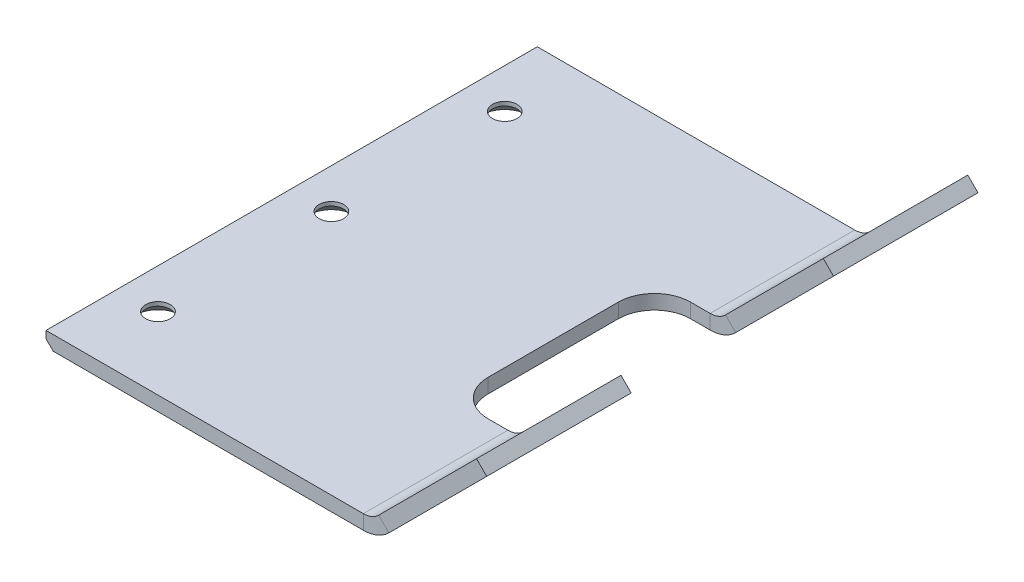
ISO-10303-21;
HEADER;
FILE_DESCRIPTION(('STEP AP214'),'2;1');
FILE_NAME('part.step','',(''),(''),'','','');
FILE_SCHEMA(('AUTOMOTIVE_DESIGN { 1 0 10303 214 1 1 1 1 }'));
ENDSEC;
DATA;
#1=APPLICATION_CONTEXT('core data for automotive mechanical design processes');
#2=APPLICATION_PROTOCOL_DEFINITION('international standard','automotive_design',2000,#1);
#3=PRODUCT_CONTEXT('',#1,'mechanical');
#4=PRODUCT('Part','Part','',(#3));
#5=PRODUCT_RELATED_PRODUCT_CATEGORY('part','',(#4));
#6=PRODUCT_DEFINITION_FORMATION('','',#4);
#7=PRODUCT_DEFINITION_CONTEXT('part definition',#1,'design');
#8=PRODUCT_DEFINITION('design','',#6,#7);
#9=PRODUCT_DEFINITION_SHAPE('','',#8);
#10=(LENGTH_UNIT() NAMED_UNIT(*) SI_UNIT(.MILLI.,.METRE.));
#11=(NAMED_UNIT(*) PLANE_ANGLE_UNIT() SI_UNIT($,.RADIAN.));
#12=(NAMED_UNIT(*) SI_UNIT($,.STERADIAN.) SOLID_ANGLE_UNIT());
#13=UNCERTAINTY_MEASURE_WITH_UNIT(LENGTH_MEASURE(1.E-05),#10,'distance_accuracy_value','');
#14=(GEOMETRIC_REPRESENTATION_CONTEXT(3) GLOBAL_UNCERTAINTY_ASSIGNED_CONTEXT((#13)) GLOBAL_UNIT_ASSIGNED_CONTEXT((#10,
#11,#12)) REPRESENTATION_CONTEXT('',''));
#15=CARTESIAN_POINT('',(0.,0.,0.));
#16=DIRECTION('',(0.,0.,1.));
#17=DIRECTION('',(1.,0.,0.));
#18=AXIS2_PLACEMENT_3D('',#15,#16,#17);
#19=CARTESIAN_POINT('',(-40.3183812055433,116.318381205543,34.));
#20=DIRECTION('',(-0.707106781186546,-0.707106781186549,0.));
#21=DIRECTION('',(0.707106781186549,-0.707106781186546,0.));
#22=AXIS2_PLACEMENT_3D('',#19,#20,#21);
#23=PLANE('',#22);
#24=DIRECTION('',(0.,0.,-1.));
#25=VECTOR('',#24,1.);
#26=CARTESIAN_POINT('',(61.,15.,34.));
#27=LINE('',#26,#25);
#28=CARTESIAN_POINT('',(61.,15.,34.));
#29=VERTEX_POINT('',#28);
#30=CARTESIAN_POINT('',(61.,15.,14.));
#31=VERTEX_POINT('',#30);
#32=EDGE_CURVE('E194',#29,#31,#27,.T.);
#33=ORIENTED_EDGE('',*,*,#32,.T.);
#34=DIRECTION('',(-0.707106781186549,0.707106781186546,0.));
#35=VECTOR('',#34,1.);
#36=CARTESIAN_POINT('',(144.908974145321,-68.9089741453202,14.));
#37=LINE('',#36,#35);
#38=CARTESIAN_POINT('',(59.5857864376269,16.4142135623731,14.));
#39=VERTEX_POINT('',#38);
#40=EDGE_CURVE('E215',#31,#39,#37,.T.);
#41=ORIENTED_EDGE('',*,*,#40,.T.);
#42=DIRECTION('',(0.,0.,-1.));
#43=VECTOR('',#42,1.);
#44=CARTESIAN_POINT('',(59.5857864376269,16.4142135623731,34.));
#45=LINE('',#44,#43);
#46=CARTESIAN_POINT('',(59.5857864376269,16.4142135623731,34.));
#47=VERTEX_POINT('',#46);
#48=EDGE_CURVE('E197',#47,#39,#45,.T.);
#49=ORIENTED_EDGE('',*,*,#48,.F.);
#50=DIRECTION('',(0.707106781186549,-0.707106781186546,0.));
#51=VECTOR('',#50,1.);
#52=CARTESIAN_POINT('',(-40.3183812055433,116.318381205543,34.));
#53=LINE('',#52,#51);
#54=EDGE_CURVE('E212',#47,#29,#53,.T.);
#55=ORIENTED_EDGE('',*,*,#54,.T.);
#56=EDGE_LOOP('',(#33,#41,#49,#55));
#57=FACE_BOUND('',#56,.T.);
#58=ADVANCED_FACE('F33',(#57),#23,.F.);
#59=CARTESIAN_POINT('',(-53.853915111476,102.78284729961,34.));
#60=DIRECTION('',(0.,0.,-1.));
#61=DIRECTION('',(-0.707106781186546,-0.707106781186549,0.));
#62=AXIS2_PLACEMENT_3D('',#59,#60,#61);
#63=PLANE('',#62);
#64=DIRECTION('',(0.707106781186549,-0.707106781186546,0.));
#65=VECTOR('',#64,1.);
#66=CARTESIAN_POINT('',(-53.853915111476,102.78284729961,34.));
#67=LINE('',#66,#65);
#68=CARTESIAN_POINT('',(46.0502525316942,2.87867965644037,34.));
#69=VERTEX_POINT('',#68);
#70=CARTESIAN_POINT('',(47.4644660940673,1.46446609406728,34.));
#71=VERTEX_POINT('',#70);
#72=EDGE_CURVE('E209',#69,#71,#67,.T.);
#73=ORIENTED_EDGE('',*,*,#72,.T.);
#74=DIRECTION('',(0.707106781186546,0.707106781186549,0.));
#75=VECTOR('',#74,1.);
#76=CARTESIAN_POINT('',(47.4644660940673,1.46446609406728,34.));
#77=LINE('',#76,#75);
#78=EDGE_CURVE('E206',#71,#29,#77,.T.);
#79=ORIENTED_EDGE('',*,*,#78,.T.);
#80=ORIENTED_EDGE('',*,*,#54,.F.);
#81=DIRECTION('',(0.707106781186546,0.707106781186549,0.));
#82=VECTOR('',#81,1.);
#83=CARTESIAN_POINT('',(46.0502525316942,2.87867965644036,34.));
#84=LINE('',#83,#82);
#85=EDGE_CURVE('E198',#69,#47,#84,.T.);
#86=ORIENTED_EDGE('',*,*,#85,.F.);
#87=EDGE_LOOP('',(#73,#79,#80,#86));
#88=FACE_BOUND('',#87,.T.);
#89=ADVANCED_FACE('F440',(#88),#63,.F.);
#90=CARTESIAN_POINT('',(47.4644660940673,1.46446609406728,34.));
#91=DIRECTION('',(-0.707106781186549,0.707106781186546,0.));
#92=DIRECTION('',(-0.707106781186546,-0.707106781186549,0.));
#93=AXIS2_PLACEMENT_3D('',#90,#91,#92);
#94=PLANE('',#93);
#95=DIRECTION('',(0.,0.,-1.));
#96=VECTOR('',#95,1.);
#97=CARTESIAN_POINT('',(47.4644660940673,1.46446609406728,34.));
#98=LINE('',#97,#96);
#99=CARTESIAN_POINT('',(47.4644660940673,1.46446609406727,14.));
#100=VERTEX_POINT('',#99);
#101=EDGE_CURVE('E201',#71,#100,#98,.T.);
#102=ORIENTED_EDGE('',*,*,#101,.T.);
#103=DIRECTION('',(0.707106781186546,0.707106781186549,0.));
#104=VECTOR('',#103,1.);
#105=CARTESIAN_POINT('',(47.4644660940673,1.46446609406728,14.));
#106=LINE('',#105,#104);
#107=EDGE_CURVE('E192',#100,#31,#106,.T.);
#108=ORIENTED_EDGE('',*,*,#107,.T.);
#109=ORIENTED_EDGE('',*,*,#32,.F.);
#110=ORIENTED_EDGE('',*,*,#78,.F.);
#111=EDGE_LOOP('',(#102,#108,#109,#110));
#112=FACE_BOUND('',#111,.T.);
#113=ADVANCED_FACE('F446',(#112),#94,.F.);
#114=CARTESIAN_POINT('',(127.231304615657,-86.586643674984,14.));
#115=DIRECTION('',(0.,0.,1.));
#116=DIRECTION('',(0.707106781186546,0.707106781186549,0.));
#117=AXIS2_PLACEMENT_3D('',#114,#115,#116);
#118=PLANE('',#117);
#119=DIRECTION('',(0.707106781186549,-0.707106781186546,0.));
#120=VECTOR('',#119,1.);
#121=CARTESIAN_POINT('',(131.373440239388,-82.444508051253,14.));
#122=LINE('',#121,#120);
#123=CARTESIAN_POINT('',(46.0502525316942,2.87867965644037,14.));
#124=VERTEX_POINT('',#123);
#125=EDGE_CURVE('E176',#124,#100,#122,.T.);
#126=ORIENTED_EDGE('',*,*,#125,.F.);
#127=DIRECTION('',(0.707106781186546,0.707106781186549,0.));
#128=VECTOR('',#127,1.);
#129=CARTESIAN_POINT('',(46.0502525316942,2.87867965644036,14.));
#130=LINE('',#129,#128);
#131=EDGE_CURVE('E189',#124,#39,#130,.T.);
#132=ORIENTED_EDGE('',*,*,#131,.T.);
#133=ORIENTED_EDGE('',*,*,#40,.F.);
#134=ORIENTED_EDGE('',*,*,#107,.F.);
#135=EDGE_LOOP('',(#126,#132,#133,#134));
#136=FACE_BOUND('',#135,.T.);
#137=ADVANCED_FACE('F188',(#136),#118,.F.);
#138=CARTESIAN_POINT('',(46.0502525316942,2.87867965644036,34.));
#139=DIRECTION('',(-0.707106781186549,0.707106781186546,0.));
#140=DIRECTION('',(-0.707106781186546,-0.707106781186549,0.));
#141=AXIS2_PLACEMENT_3D('',#138,#139,#140);
#142=PLANE('',#141);
#143=ORIENTED_EDGE('',*,*,#131,.F.);
#144=DIRECTION('',(0.,0.,-1.));
#145=VECTOR('',#144,1.);
#146=CARTESIAN_POINT('',(46.0502525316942,2.87867965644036,34.));
#147=LINE('',#146,#145);
#148=EDGE_CURVE('E165',#69,#124,#147,.T.);
#149=ORIENTED_EDGE('',*,*,#148,.F.);
#150=ORIENTED_EDGE('',*,*,#85,.T.);
#151=ORIENTED_EDGE('',*,*,#48,.T.);
#152=EDGE_LOOP('',(#143,#149,#150,#151));
#153=FACE_BOUND('',#152,.T.);
#154=ADVANCED_FACE('F35',(#153),#142,.T.);
#155=CARTESIAN_POINT('',(-40.3183812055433,116.318381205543,34.));
#156=DIRECTION('',(-0.707106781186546,-0.707106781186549,0.));
#157=DIRECTION('',(0.707106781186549,-0.707106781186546,0.));
#158=AXIS2_PLACEMENT_3D('',#155,#156,#157);
#159=PLANE('',#158);
#160=DIRECTION('',(0.,0.,-1.));
#161=VECTOR('',#160,1.);
#162=CARTESIAN_POINT('',(59.5857864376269,16.4142135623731,34.));
#163=LINE('',#162,#161);
#164=CARTESIAN_POINT('',(59.5857864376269,16.4142135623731,-14.));
#165=VERTEX_POINT('',#164);
#166=CARTESIAN_POINT('',(59.5857864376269,16.4142135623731,-34.));
#167=VERTEX_POINT('',#166);
#168=EDGE_CURVE('E177',#165,#167,#163,.T.);
#169=ORIENTED_EDGE('',*,*,#168,.F.);
#170=DIRECTION('',(-0.707106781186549,0.707106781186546,0.));
#171=VECTOR('',#170,1.);
#172=CARTESIAN_POINT('',(144.908974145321,-68.9089741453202,-14.));
#173=LINE('',#172,#171);
#174=CARTESIAN_POINT('',(61.,15.,-14.));
#175=VERTEX_POINT('',#174);
#176=EDGE_CURVE('E236',#175,#165,#173,.T.);
#177=ORIENTED_EDGE('',*,*,#176,.F.);
#178=DIRECTION('',(0.,0.,-1.));
#179=VECTOR('',#178,1.);
#180=CARTESIAN_POINT('',(61.,15.,34.));
#181=LINE('',#180,#179);
#182=CARTESIAN_POINT('',(61.,15.,-34.));
#183=VERTEX_POINT('',#182);
#184=EDGE_CURVE('E234',#175,#183,#181,.T.);
#185=ORIENTED_EDGE('',*,*,#184,.T.);
#186=DIRECTION('',(0.707106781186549,-0.707106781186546,0.));
#187=VECTOR('',#186,1.);
#188=CARTESIAN_POINT('',(-40.3183812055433,116.318381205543,-34.));
#189=LINE('',#188,#187);
#190=EDGE_CURVE('E253',#167,#183,#189,.T.);
#191=ORIENTED_EDGE('',*,*,#190,.F.);
#192=EDGE_LOOP('',(#169,#177,#185,#191));
#193=FACE_BOUND('',#192,.T.);
#194=ADVANCED_FACE('F425',(#193),#159,.F.);
#195=CARTESIAN_POINT('',(127.231304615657,-86.586643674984,-14.));
#196=DIRECTION('',(0.,0.,-1.));
#197=DIRECTION('',(-0.707106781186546,-0.707106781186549,0.));
#198=AXIS2_PLACEMENT_3D('',#195,#196,#197);
#199=PLANE('',#198);
#200=DIRECTION('',(-0.707106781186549,0.707106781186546,0.));
#201=VECTOR('',#200,1.);
#202=CARTESIAN_POINT('',(131.373440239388,-82.444508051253,-14.));
#203=LINE('',#202,#201);
#204=CARTESIAN_POINT('',(47.4644660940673,1.46446609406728,-14.));
#205=VERTEX_POINT('',#204);
#206=CARTESIAN_POINT('',(46.0502525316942,2.87867965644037,-14.));
#207=VERTEX_POINT('',#206);
#208=EDGE_CURVE('E226',#205,#207,#203,.T.);
#209=ORIENTED_EDGE('',*,*,#208,.F.);
#210=DIRECTION('',(-0.707106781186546,-0.707106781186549,0.));
#211=VECTOR('',#210,1.);
#212=CARTESIAN_POINT('',(47.4644660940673,1.46446609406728,-14.));
#213=LINE('',#212,#211);
#214=EDGE_CURVE('E241',#175,#205,#213,.T.);
#215=ORIENTED_EDGE('',*,*,#214,.F.);
#216=ORIENTED_EDGE('',*,*,#176,.T.);
#217=DIRECTION('',(-0.707106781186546,-0.707106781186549,0.));
#218=VECTOR('',#217,1.);
#219=CARTESIAN_POINT('',(46.0502525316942,2.87867965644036,-14.));
#220=LINE('',#219,#218);
#221=EDGE_CURVE('E238',#165,#207,#220,.T.);
#222=ORIENTED_EDGE('',*,*,#221,.T.);
#223=EDGE_LOOP('',(#209,#215,#216,#222));
#224=FACE_BOUND('',#223,.T.);
#225=ADVANCED_FACE('F415',(#224),#199,.F.);
#226=CARTESIAN_POINT('',(47.4644660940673,1.46446609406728,34.));
#227=DIRECTION('',(-0.707106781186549,0.707106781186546,0.));
#228=DIRECTION('',(-0.707106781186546,-0.707106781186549,0.));
#229=AXIS2_PLACEMENT_3D('',#226,#227,#228);
#230=PLANE('',#229);
#231=ORIENTED_EDGE('',*,*,#184,.F.);
#232=ORIENTED_EDGE('',*,*,#214,.T.);
#233=DIRECTION('',(0.,0.,-1.));
#234=VECTOR('',#233,1.);
#235=CARTESIAN_POINT('',(47.4644660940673,1.46446609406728,34.));
#236=LINE('',#235,#234);
#237=CARTESIAN_POINT('',(47.4644660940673,1.46446609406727,-34.));
#238=VERTEX_POINT('',#237);
#239=EDGE_CURVE('E244',#205,#238,#236,.T.);
#240=ORIENTED_EDGE('',*,*,#239,.T.);
#241=DIRECTION('',(0.707106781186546,0.707106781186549,0.));
#242=VECTOR('',#241,1.);
#243=CARTESIAN_POINT('',(47.4644660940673,1.46446609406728,-34.));
#244=LINE('',#243,#242);
#245=EDGE_CURVE('E247',#238,#183,#244,.T.);
#246=ORIENTED_EDGE('',*,*,#245,.T.);
#247=EDGE_LOOP('',(#231,#232,#240,#246));
#248=FACE_BOUND('',#247,.T.);
#249=ADVANCED_FACE('F420',(#248),#230,.F.);
#250=CARTESIAN_POINT('',(-53.853915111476,102.78284729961,-34.));
#251=DIRECTION('',(0.,0.,-1.));
#252=DIRECTION('',(-0.707106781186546,-0.707106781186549,0.));
#253=AXIS2_PLACEMENT_3D('',#250,#251,#252);
#254=PLANE('',#253);
#255=ORIENTED_EDGE('',*,*,#245,.F.);
#256=DIRECTION('',(0.707106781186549,-0.707106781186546,0.));
#257=VECTOR('',#256,1.);
#258=CARTESIAN_POINT('',(-53.853915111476,102.78284729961,-34.));
#259=LINE('',#258,#257);
#260=CARTESIAN_POINT('',(46.0502525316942,2.87867965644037,-34.));
#261=VERTEX_POINT('',#260);
#262=EDGE_CURVE('E231',#261,#238,#259,.T.);
#263=ORIENTED_EDGE('',*,*,#262,.F.);
#264=DIRECTION('',(0.707106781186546,0.707106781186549,0.));
#265=VECTOR('',#264,1.);
#266=CARTESIAN_POINT('',(46.0502525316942,2.87867965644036,-34.));
#267=LINE('',#266,#265);
#268=EDGE_CURVE('E250',#261,#167,#267,.T.);
#269=ORIENTED_EDGE('',*,*,#268,.T.);
#270=ORIENTED_EDGE('',*,*,#190,.T.);
#271=EDGE_LOOP('',(#255,#263,#269,#270));
#272=FACE_BOUND('',#271,.T.);
#273=ADVANCED_FACE('F430',(#272),#254,.T.);
#274=CARTESIAN_POINT('',(46.0502525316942,2.87867965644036,34.));
#275=DIRECTION('',(-0.707106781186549,0.707106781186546,0.));
#276=DIRECTION('',(-0.707106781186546,-0.707106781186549,0.));
#277=AXIS2_PLACEMENT_3D('',#274,#275,#276);
#278=PLANE('',#277);
#279=ORIENTED_EDGE('',*,*,#221,.F.);
#280=ORIENTED_EDGE('',*,*,#168,.T.);
#281=ORIENTED_EDGE('',*,*,#268,.F.);
#282=DIRECTION('',(0.,0.,-1.));
#283=VECTOR('',#282,1.);
#284=CARTESIAN_POINT('',(46.0502525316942,2.87867965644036,34.));
#285=LINE('',#284,#283);
#286=EDGE_CURVE('E228',#207,#261,#285,.T.);
#287=ORIENTED_EDGE('',*,*,#286,.F.);
#288=EDGE_LOOP('',(#279,#280,#281,#287));
#289=FACE_BOUND('',#288,.T.);
#290=ADVANCED_FACE('F427',(#289),#278,.T.);
#291=CARTESIAN_POINT('',(41.2126604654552,-118.665209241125,-14.));
#292=DIRECTION('',(0.,0.,-1.));
#293=DIRECTION('',(-1.,0.,0.));
#294=AXIS2_PLACEMENT_3D('',#291,#292,#293);
#295=PLANE('',#294);
#296=DIRECTION('',(-1.,0.,0.));
#297=VECTOR('',#296,1.);
#298=CARTESIAN_POINT('',(0.,0.,-14.));
#299=LINE('',#298,#297);
#300=CARTESIAN_POINT('',(43.9289321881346,0.,-14.));
#301=VERTEX_POINT('',#300);
#302=CARTESIAN_POINT('',(41.2126604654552,0.,-14.));
#303=VERTEX_POINT('',#302);
#304=EDGE_CURVE('E332',#301,#303,#299,.T.);
#305=ORIENTED_EDGE('',*,*,#304,.F.);
#306=DIRECTION('',(0.,1.,0.));
#307=VECTOR('',#306,1.);
#308=CARTESIAN_POINT('',(43.9289321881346,-118.665209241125,-14.));
#309=LINE('',#308,#307);
#310=CARTESIAN_POINT('',(43.9289321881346,2.,-14.));
#311=VERTEX_POINT('',#310);
#312=EDGE_CURVE('E229',#301,#311,#309,.T.);
#313=ORIENTED_EDGE('',*,*,#312,.T.);
#314=DIRECTION('',(-1.,0.,0.));
#315=VECTOR('',#314,1.);
#316=CARTESIAN_POINT('',(0.,2.,-14.));
#317=LINE('',#316,#315);
#318=CARTESIAN_POINT('',(41.2126604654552,2.,-14.));
#319=VERTEX_POINT('',#318);
#320=EDGE_CURVE('E335',#311,#319,#317,.T.);
#321=ORIENTED_EDGE('',*,*,#320,.T.);
#322=DIRECTION('',(0.,1.,0.));
#323=VECTOR('',#322,1.);
#324=CARTESIAN_POINT('',(41.2126604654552,-118.665209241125,-14.));
#325=LINE('',#324,#323);
#326=EDGE_CURVE('E342',#303,#319,#325,.T.);
#327=ORIENTED_EDGE('',*,*,#326,.F.);
#328=EDGE_LOOP('',(#305,#313,#321,#327));
#329=FACE_BOUND('',#328,.T.);
#330=ADVANCED_FACE('F401',(#329),#295,.F.);
#331=CARTESIAN_POINT('',(41.2126604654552,-118.665209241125,14.));
#332=DIRECTION('',(0.,0.,1.));
#333=DIRECTION('',(1.,0.,0.));
#334=AXIS2_PLACEMENT_3D('',#331,#332,#333);
#335=PLANE('',#334);
#336=DIRECTION('',(1.,0.,0.));
#337=VECTOR('',#336,1.);
#338=CARTESIAN_POINT('',(0.,2.,14.));
#339=LINE('',#338,#337);
#340=CARTESIAN_POINT('',(41.2126604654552,2.,14.));
#341=VERTEX_POINT('',#340);
#342=CARTESIAN_POINT('',(43.9289321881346,2.,14.));
#343=VERTEX_POINT('',#342);
#344=EDGE_CURVE('E340',#341,#343,#339,.T.);
#345=ORIENTED_EDGE('',*,*,#344,.T.);
#346=DIRECTION('',(0.,-1.,0.));
#347=VECTOR('',#346,1.);
#348=CARTESIAN_POINT('',(43.9289321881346,-118.665209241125,14.));
#349=LINE('',#348,#347);
#350=CARTESIAN_POINT('',(43.9289321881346,0.,14.));
#351=VERTEX_POINT('',#350);
#352=EDGE_CURVE('E185',#343,#351,#349,.T.);
#353=ORIENTED_EDGE('',*,*,#352,.T.);
#354=DIRECTION('',(1.,0.,0.));
#355=VECTOR('',#354,1.);
#356=CARTESIAN_POINT('',(0.,0.,14.));
#357=LINE('',#356,#355);
#358=CARTESIAN_POINT('',(41.2126604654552,0.,14.));
#359=VERTEX_POINT('',#358);
#360=EDGE_CURVE('E337',#359,#351,#357,.T.);
#361=ORIENTED_EDGE('',*,*,#360,.F.);
#362=DIRECTION('',(0.,1.,0.));
#363=VECTOR('',#362,1.);
#364=CARTESIAN_POINT('',(41.2126604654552,-118.665209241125,14.));
#365=LINE('',#364,#363);
#366=EDGE_CURVE('E351',#359,#341,#365,.T.);
#367=ORIENTED_EDGE('',*,*,#366,.T.);
#368=EDGE_LOOP('',(#345,#353,#361,#367));
#369=FACE_BOUND('',#368,.T.);
#370=ADVANCED_FACE('F465',(#369),#335,.F.);
#371=CARTESIAN_POINT('',(0.,0.,34.));
#372=DIRECTION('',(0.,1.,0.));
#373=DIRECTION('',(0.,0.,1.));
#374=AXIS2_PLACEMENT_3D('',#371,#372,#373);
#375=PLANE('',#374);
#376=CARTESIAN_POINT('',(5.5,0.,0.));
#377=DIRECTION('',(0.,-1.,0.));
#378=DIRECTION('',(0.,0.,-1.));
#379=AXIS2_PLACEMENT_3D('',#376,#377,#378);
#380=CIRCLE('',#379,3.15);
#381=CARTESIAN_POINT('',(5.5,0.,-3.15));
#382=VERTEX_POINT('',#381);
#383=EDGE_CURVE('E320',#382,#382,#380,.T.);
#384=ORIENTED_EDGE('',*,*,#383,.F.);
#385=EDGE_LOOP('',(#384));
#386=FACE_BOUND('',#385,.T.);
#387=CARTESIAN_POINT('',(5.5,0.,24.));
#388=DIRECTION('',(0.,-1.,0.));
#389=DIRECTION('',(0.,0.,-1.));
#390=AXIS2_PLACEMENT_3D('',#387,#388,#389);
#391=CIRCLE('',#390,3.15);
#392=CARTESIAN_POINT('',(5.5,0.,20.85));
#393=VERTEX_POINT('',#392);
#394=EDGE_CURVE('E311',#393,#393,#391,.T.);
#395=ORIENTED_EDGE('',*,*,#394,.F.);
#396=EDGE_LOOP('',(#395));
#397=FACE_BOUND('',#396,.T.);
#398=DIRECTION('',(1.,0.,0.));
#399=VECTOR('',#398,1.);
#400=CARTESIAN_POINT('',(0.,0.,34.));
#401=LINE('',#400,#399);
#402=CARTESIAN_POINT('',(0.999999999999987,0.,34.));
#403=VERTEX_POINT('',#402);
#404=CARTESIAN_POINT('',(43.9289321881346,0.,34.));
#405=VERTEX_POINT('',#404);
#406=EDGE_CURVE('E297',#403,#405,#401,.T.);
#407=ORIENTED_EDGE('',*,*,#406,.F.);
#408=DIRECTION('',(0.,0.,-1.));
#409=VECTOR('',#408,1.);
#410=CARTESIAN_POINT('',(0.999999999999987,0.,-34.));
#411=LINE('',#410,#409);
#412=CARTESIAN_POINT('',(1.00000000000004,0.,-34.));
#413=VERTEX_POINT('',#412);
#414=EDGE_CURVE('E219',#403,#413,#411,.T.);
#415=ORIENTED_EDGE('',*,*,#414,.T.);
#416=DIRECTION('',(1.,0.,0.));
#417=VECTOR('',#416,1.);
#418=CARTESIAN_POINT('',(0.,0.,-34.));
#419=LINE('',#418,#417);
#420=CARTESIAN_POINT('',(43.9289321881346,0.,-34.));
#421=VERTEX_POINT('',#420);
#422=EDGE_CURVE('E303',#413,#421,#419,.T.);
#423=ORIENTED_EDGE('',*,*,#422,.T.);
#424=DIRECTION('',(0.,0.,-1.));
#425=VECTOR('',#424,1.);
#426=CARTESIAN_POINT('',(43.9289321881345,0.,34.));
#427=LINE('',#426,#425);
#428=EDGE_CURVE('E302',#301,#421,#427,.T.);
#429=ORIENTED_EDGE('',*,*,#428,.F.);
#430=ORIENTED_EDGE('',*,*,#304,.T.);
#431=CARTESIAN_POINT('',(41.2126604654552,0.,-9.));
#432=DIRECTION('',(0.,1.,0.));
#433=DIRECTION('',(0.,0.,1.));
#434=AXIS2_PLACEMENT_3D('',#431,#432,#433);
#435=CIRCLE('',#434,5.);
#436=CARTESIAN_POINT('',(36.2126604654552,0.,-9.));
#437=VERTEX_POINT('',#436);
#438=EDGE_CURVE('E323',#303,#437,#435,.T.);
#439=ORIENTED_EDGE('',*,*,#438,.T.);
#440=DIRECTION('',(0.,0.,1.));
#441=VECTOR('',#440,1.);
#442=CARTESIAN_POINT('',(36.2126604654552,0.,34.));
#443=LINE('',#442,#441);
#444=CARTESIAN_POINT('',(36.2126604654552,0.,9.));
#445=VERTEX_POINT('',#444);
#446=EDGE_CURVE('E326',#437,#445,#443,.T.);
#447=ORIENTED_EDGE('',*,*,#446,.T.);
#448=CARTESIAN_POINT('',(41.2126604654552,0.,9.));
#449=DIRECTION('',(0.,1.,0.));
#450=DIRECTION('',(0.,0.,1.));
#451=AXIS2_PLACEMENT_3D('',#448,#449,#450);
#452=CIRCLE('',#451,5.);
#453=EDGE_CURVE('E329',#445,#359,#452,.T.);
#454=ORIENTED_EDGE('',*,*,#453,.T.);
#455=ORIENTED_EDGE('',*,*,#360,.T.);
#456=EDGE_CURVE('E299',#405,#351,#427,.T.);
#457=ORIENTED_EDGE('',*,*,#456,.F.);
#458=EDGE_LOOP('',(#407,#415,#423,#429,#430,#439,#447,#454,#455,#457));
#459=FACE_BOUND('',#458,.T.);
#460=CARTESIAN_POINT('',(5.5,0.,-24.));
#461=DIRECTION('',(0.,-1.,0.));
#462=DIRECTION('',(0.,0.,-1.));
#463=AXIS2_PLACEMENT_3D('',#460,#461,#462);
#464=CIRCLE('',#463,3.15);
#465=CARTESIAN_POINT('',(5.5,0.,-27.15));
#466=VERTEX_POINT('',#465);
#467=EDGE_CURVE('E272',#466,#466,#464,.T.);
#468=ORIENTED_EDGE('',*,*,#467,.F.);
#469=EDGE_LOOP('',(#468));
#470=FACE_BOUND('',#469,.T.);
#471=ADVANCED_FACE('F405',(#386,#397,#459,#470),#375,.F.);
#472=CARTESIAN_POINT('',(0.,163.910482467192,-34.));
#473=DIRECTION('',(0.,0.,-1.));
#474=DIRECTION('',(-1.,0.,0.));
#475=AXIS2_PLACEMENT_3D('',#472,#473,#474);
#476=PLANE('',#475);
#477=ORIENTED_EDGE('',*,*,#422,.F.);
#478=DIRECTION('',(-0.707106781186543,0.707106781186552,0.));
#479=VECTOR('',#478,1.);
#480=CARTESIAN_POINT('',(-81.455241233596,82.4552412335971,-34.));
#481=LINE('',#480,#479);
#482=CARTESIAN_POINT('',(0.,1.,-34.));
#483=VERTEX_POINT('',#482);
#484=EDGE_CURVE('E55',#413,#483,#481,.T.);
#485=ORIENTED_EDGE('',*,*,#484,.T.);
#486=DIRECTION('',(0.,-1.,0.));
#487=VECTOR('',#486,1.);
#488=CARTESIAN_POINT('',(0.,163.910482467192,-34.));
#489=LINE('',#488,#487);
#490=CARTESIAN_POINT('',(0.,2.,-34.));
#491=VERTEX_POINT('',#490);
#492=EDGE_CURVE('E275',#491,#483,#489,.T.);
#493=ORIENTED_EDGE('',*,*,#492,.F.);
#494=DIRECTION('',(1.,0.,0.));
#495=VECTOR('',#494,1.);
#496=CARTESIAN_POINT('',(0.,2.,-34.));
#497=LINE('',#496,#495);
#498=CARTESIAN_POINT('',(43.9289321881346,2.,-34.));
#499=VERTEX_POINT('',#498);
#500=EDGE_CURVE('E294',#491,#499,#497,.T.);
#501=ORIENTED_EDGE('',*,*,#500,.T.);
#502=DIRECTION('',(0.,-1.,0.));
#503=VECTOR('',#502,1.);
#504=CARTESIAN_POINT('',(43.9289321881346,163.910482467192,-34.));
#505=LINE('',#504,#503);
#506=EDGE_CURVE('E282',#499,#421,#505,.T.);
#507=ORIENTED_EDGE('',*,*,#506,.T.);
#508=EDGE_LOOP('',(#477,#485,#493,#501,#507));
#509=FACE_BOUND('',#508,.T.);
#510=ADVANCED_FACE('F385',(#509),#476,.T.);
#511=CARTESIAN_POINT('',(0.,163.910482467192,34.));
#512=DIRECTION('',(-1.,0.,0.));
#513=DIRECTION('',(0.,0.,1.));
#514=AXIS2_PLACEMENT_3D('',#511,#512,#513);
#515=PLANE('',#514);
#516=ORIENTED_EDGE('',*,*,#492,.T.);
#517=DIRECTION('',(0.,0.,1.));
#518=VECTOR('',#517,1.);
#519=CARTESIAN_POINT('',(0.,1.,34.));
#520=LINE('',#519,#518);
#521=CARTESIAN_POINT('',(0.,1.00000000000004,34.));
#522=VERTEX_POINT('',#521);
#523=EDGE_CURVE('E41',#483,#522,#520,.T.);
#524=ORIENTED_EDGE('',*,*,#523,.T.);
#525=DIRECTION('',(0.,-1.,0.));
#526=VECTOR('',#525,1.);
#527=CARTESIAN_POINT('',(0.,163.910482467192,34.));
#528=LINE('',#527,#526);
#529=CARTESIAN_POINT('',(0.,2.,34.));
#530=VERTEX_POINT('',#529);
#531=EDGE_CURVE('E277',#530,#522,#528,.T.);
#532=ORIENTED_EDGE('',*,*,#531,.F.);
#533=DIRECTION('',(0.,0.,-1.));
#534=VECTOR('',#533,1.);
#535=CARTESIAN_POINT('',(0.,2.,34.));
#536=LINE('',#535,#534);
#537=EDGE_CURVE('E292',#530,#491,#536,.T.);
#538=ORIENTED_EDGE('',*,*,#537,.T.);
#539=EDGE_LOOP('',(#516,#524,#532,#538));
#540=FACE_BOUND('',#539,.T.);
#541=ADVANCED_FACE('F384',(#540),#515,.T.);
#542=CARTESIAN_POINT('',(0.,163.910482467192,34.));
#543=DIRECTION('',(0.,0.,-1.));
#544=DIRECTION('',(-1.,0.,0.));
#545=AXIS2_PLACEMENT_3D('',#542,#543,#544);
#546=PLANE('',#545);
#547=ORIENTED_EDGE('',*,*,#531,.T.);
#548=DIRECTION('',(0.707106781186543,-0.707106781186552,0.));
#549=VECTOR('',#548,1.);
#550=CARTESIAN_POINT('',(0.999999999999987,0.,34.));
#551=LINE('',#550,#549);
#552=EDGE_CURVE('E11',#522,#403,#551,.T.);
#553=ORIENTED_EDGE('',*,*,#552,.T.);
#554=ORIENTED_EDGE('',*,*,#406,.T.);
#555=DIRECTION('',(0.,-1.,0.));
#556=VECTOR('',#555,1.);
#557=CARTESIAN_POINT('',(43.9289321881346,163.910482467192,34.));
#558=LINE('',#557,#556);
#559=CARTESIAN_POINT('',(43.9289321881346,2.,34.));
#560=VERTEX_POINT('',#559);
#561=EDGE_CURVE('E279',#560,#405,#558,.T.);
#562=ORIENTED_EDGE('',*,*,#561,.F.);
#563=DIRECTION('',(1.,0.,0.));
#564=VECTOR('',#563,1.);
#565=CARTESIAN_POINT('',(0.,2.,34.));
#566=LINE('',#565,#564);
#567=EDGE_CURVE('E289',#530,#560,#566,.T.);
#568=ORIENTED_EDGE('',*,*,#567,.F.);
#569=EDGE_LOOP('',(#547,#553,#554,#562,#568));
#570=FACE_BOUND('',#569,.T.);
#571=ADVANCED_FACE('F375',(#570),#546,.F.);
#572=CARTESIAN_POINT('',(0.,2.,34.));
#573=DIRECTION('',(0.,1.,0.));
#574=DIRECTION('',(0.,0.,1.));
#575=AXIS2_PLACEMENT_3D('',#572,#573,#574);
#576=PLANE('',#575);
#577=ORIENTED_EDGE('',*,*,#320,.F.);
#578=DIRECTION('',(0.,0.,-1.));
#579=VECTOR('',#578,1.);
#580=CARTESIAN_POINT('',(43.9289321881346,2.,34.));
#581=LINE('',#580,#579);
#582=EDGE_CURVE('E288',#311,#499,#581,.T.);
#583=ORIENTED_EDGE('',*,*,#582,.T.);
#584=ORIENTED_EDGE('',*,*,#500,.F.);
#585=ORIENTED_EDGE('',*,*,#537,.F.);
#586=ORIENTED_EDGE('',*,*,#567,.T.);
#587=EDGE_CURVE('E285',#560,#343,#581,.T.);
#588=ORIENTED_EDGE('',*,*,#587,.T.);
#589=ORIENTED_EDGE('',*,*,#344,.F.);
#590=CARTESIAN_POINT('',(41.2126604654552,2.,9.));
#591=DIRECTION('',(0.,1.,0.));
#592=DIRECTION('',(0.,0.,1.));
#593=AXIS2_PLACEMENT_3D('',#590,#591,#592);
#594=CIRCLE('',#593,5.);
#595=CARTESIAN_POINT('',(36.2126604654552,2.,9.));
#596=VERTEX_POINT('',#595);
#597=EDGE_CURVE('E264',#596,#341,#594,.T.);
#598=ORIENTED_EDGE('',*,*,#597,.F.);
#599=DIRECTION('',(0.,0.,1.));
#600=VECTOR('',#599,1.);
#601=CARTESIAN_POINT('',(36.2126604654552,2.,34.));
#602=LINE('',#601,#600);
#603=CARTESIAN_POINT('',(36.2126604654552,2.,-9.));
#604=VERTEX_POINT('',#603);
#605=EDGE_CURVE('E262',#604,#596,#602,.T.);
#606=ORIENTED_EDGE('',*,*,#605,.F.);
#607=CARTESIAN_POINT('',(41.2126604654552,2.,-9.));
#608=DIRECTION('',(0.,1.,0.));
#609=DIRECTION('',(0.,0.,1.));
#610=AXIS2_PLACEMENT_3D('',#607,#608,#609);
#611=CIRCLE('',#610,5.);
#612=EDGE_CURVE('E260',#319,#604,#611,.T.);
#613=ORIENTED_EDGE('',*,*,#612,.F.);
#614=EDGE_LOOP('',(#577,#583,#584,#585,#586,#588,#589,#598,#606,#613));
#615=FACE_BOUND('',#614,.T.);
#616=CARTESIAN_POINT('',(5.5,2.,0.));
#617=DIRECTION('',(0.,-1.,0.));
#618=DIRECTION('',(0.,0.,-1.));
#619=AXIS2_PLACEMENT_3D('',#616,#617,#618);
#620=CIRCLE('',#619,1.7);
#621=CARTESIAN_POINT('',(5.5,2.,-1.7));
#622=VERTEX_POINT('',#621);
#623=EDGE_CURVE('E317',#622,#622,#620,.T.);
#624=ORIENTED_EDGE('',*,*,#623,.T.);
#625=EDGE_LOOP('',(#624));
#626=FACE_BOUND('',#625,.T.);
#627=CARTESIAN_POINT('',(5.5,2.,24.));
#628=DIRECTION('',(0.,-1.,0.));
#629=DIRECTION('',(0.,0.,-1.));
#630=AXIS2_PLACEMENT_3D('',#627,#628,#629);
#631=CIRCLE('',#630,1.7);
#632=CARTESIAN_POINT('',(5.5,2.,22.3));
#633=VERTEX_POINT('',#632);
#634=EDGE_CURVE('E305',#633,#633,#631,.T.);
#635=ORIENTED_EDGE('',*,*,#634,.T.);
#636=EDGE_LOOP('',(#635));
#637=FACE_BOUND('',#636,.T.);
#638=CARTESIAN_POINT('',(5.5,2.,-24.));
#639=DIRECTION('',(0.,-1.,0.));
#640=DIRECTION('',(0.,0.,-1.));
#641=AXIS2_PLACEMENT_3D('',#638,#639,#640);
#642=CIRCLE('',#641,1.7);
#643=CARTESIAN_POINT('',(5.5,2.,-25.7));
#644=VERTEX_POINT('',#643);
#645=EDGE_CURVE('E269',#644,#644,#642,.T.);
#646=ORIENTED_EDGE('',*,*,#645,.T.);
#647=EDGE_LOOP('',(#646));
#648=FACE_BOUND('',#647,.T.);
#649=ADVANCED_FACE('F379',(#615,#626,#637,#648),#576,.T.);
#650=CARTESIAN_POINT('',(5.5,0.,24.));
#651=DIRECTION('',(0.,-1.,0.));
#652=DIRECTION('',(0.,0.,-1.));
#653=AXIS2_PLACEMENT_3D('',#650,#651,#652);
#654=CYLINDRICAL_SURFACE('',#653,1.7);
#655=ORIENTED_EDGE('',*,*,#634,.F.);
#656=EDGE_LOOP('',(#655));
#657=FACE_BOUND('',#656,.T.);
#658=CARTESIAN_POINT('',(5.5,1.45,24.));
#659=DIRECTION('',(0.,-1.,0.));
#660=DIRECTION('',(0.,0.,-1.));
#661=AXIS2_PLACEMENT_3D('',#658,#659,#660);
#662=CIRCLE('',#661,1.7);
#663=CARTESIAN_POINT('',(5.5,1.45,22.3));
#664=VERTEX_POINT('',#663);
#665=EDGE_CURVE('E308',#664,#664,#662,.T.);
#666=ORIENTED_EDGE('',*,*,#665,.T.);
#667=EDGE_LOOP('',(#666));
#668=FACE_BOUND('',#667,.T.);
#669=ADVANCED_FACE('F489',(#657,#668),#654,.F.);
#670=CARTESIAN_POINT('',(5.5,0.,24.));
#671=DIRECTION('',(0.,-1.,0.));
#672=DIRECTION('',(0.,0.,-1.));
#673=AXIS2_PLACEMENT_3D('',#670,#671,#672);
#674=CONICAL_SURFACE('',#673,3.15,0.785398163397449);
#675=ORIENTED_EDGE('',*,*,#665,.F.);
#676=EDGE_LOOP('',(#675));
#677=FACE_BOUND('',#676,.T.);
#678=ORIENTED_EDGE('',*,*,#394,.T.);
#679=EDGE_LOOP('',(#678));
#680=FACE_BOUND('',#679,.T.);
#681=ADVANCED_FACE('F495',(#677,#680),#674,.F.);
#682=CARTESIAN_POINT('',(5.5,0.,0.));
#683=DIRECTION('',(0.,-1.,0.));
#684=DIRECTION('',(0.,0.,-1.));
#685=AXIS2_PLACEMENT_3D('',#682,#683,#684);
#686=CYLINDRICAL_SURFACE('',#685,1.7);
#687=ORIENTED_EDGE('',*,*,#623,.F.);
#688=EDGE_LOOP('',(#687));
#689=FACE_BOUND('',#688,.T.);
#690=CARTESIAN_POINT('',(5.5,1.45,0.));
#691=DIRECTION('',(0.,-1.,0.));
#692=DIRECTION('',(0.,0.,-1.));
#693=AXIS2_PLACEMENT_3D('',#690,#691,#692);
#694=CIRCLE('',#693,1.7);
#695=CARTESIAN_POINT('',(5.5,1.45,-1.7));
#696=VERTEX_POINT('',#695);
#697=EDGE_CURVE('E314',#696,#696,#694,.T.);
#698=ORIENTED_EDGE('',*,*,#697,.T.);
#699=EDGE_LOOP('',(#698));
#700=FACE_BOUND('',#699,.T.);
#701=ADVANCED_FACE('F477',(#689,#700),#686,.F.);
#702=CARTESIAN_POINT('',(5.5,0.,0.));
#703=DIRECTION('',(0.,-1.,0.));
#704=DIRECTION('',(0.,0.,-1.));
#705=AXIS2_PLACEMENT_3D('',#702,#703,#704);
#706=CONICAL_SURFACE('',#705,3.15,0.785398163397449);
#707=ORIENTED_EDGE('',*,*,#697,.F.);
#708=EDGE_LOOP('',(#707));
#709=FACE_BOUND('',#708,.T.);
#710=ORIENTED_EDGE('',*,*,#383,.T.);
#711=EDGE_LOOP('',(#710));
#712=FACE_BOUND('',#711,.T.);
#713=ADVANCED_FACE('F475',(#709,#712),#706,.F.);
#714=CARTESIAN_POINT('',(5.5,0.,-24.));
#715=DIRECTION('',(0.,-1.,0.));
#716=DIRECTION('',(0.,0.,-1.));
#717=AXIS2_PLACEMENT_3D('',#714,#715,#716);
#718=CONICAL_SURFACE('',#717,3.15,0.785398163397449);
#719=CARTESIAN_POINT('',(5.5,1.45,-24.));
#720=DIRECTION('',(0.,-1.,0.));
#721=DIRECTION('',(0.,0.,-1.));
#722=AXIS2_PLACEMENT_3D('',#719,#720,#721);
#723=CIRCLE('',#722,1.7);
#724=CARTESIAN_POINT('',(5.5,1.45,-25.7));
#725=VERTEX_POINT('',#724);
#726=EDGE_CURVE('E266',#725,#725,#723,.T.);
#727=ORIENTED_EDGE('',*,*,#726,.F.);
#728=EDGE_LOOP('',(#727));
#729=FACE_BOUND('',#728,.T.);
#730=ORIENTED_EDGE('',*,*,#467,.T.);
#731=EDGE_LOOP('',(#730));
#732=FACE_BOUND('',#731,.T.);
#733=ADVANCED_FACE('F471',(#729,#732),#718,.F.);
#734=CARTESIAN_POINT('',(5.5,0.,-24.));
#735=DIRECTION('',(0.,-1.,0.));
#736=DIRECTION('',(0.,0.,-1.));
#737=AXIS2_PLACEMENT_3D('',#734,#735,#736);
#738=CYLINDRICAL_SURFACE('',#737,1.7);
#739=ORIENTED_EDGE('',*,*,#645,.F.);
#740=EDGE_LOOP('',(#739));
#741=FACE_BOUND('',#740,.T.);
#742=ORIENTED_EDGE('',*,*,#726,.T.);
#743=EDGE_LOOP('',(#742));
#744=FACE_BOUND('',#743,.T.);
#745=ADVANCED_FACE('F474',(#741,#744),#738,.F.);
#746=CARTESIAN_POINT('',(41.2126604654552,-118.665209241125,-9.));
#747=DIRECTION('',(0.,1.,0.));
#748=DIRECTION('',(-1.,0.,0.));
#749=AXIS2_PLACEMENT_3D('',#746,#747,#748);
#750=CYLINDRICAL_SURFACE('',#749,5.);
#751=ORIENTED_EDGE('',*,*,#438,.F.);
#752=ORIENTED_EDGE('',*,*,#326,.T.);
#753=ORIENTED_EDGE('',*,*,#612,.T.);
#754=DIRECTION('',(0.,1.,0.));
#755=VECTOR('',#754,1.);
#756=CARTESIAN_POINT('',(36.2126604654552,-118.665209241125,-9.));
#757=LINE('',#756,#755);
#758=EDGE_CURVE('E345',#437,#604,#757,.T.);
#759=ORIENTED_EDGE('',*,*,#758,.F.);
#760=EDGE_LOOP('',(#751,#752,#753,#759));
#761=FACE_BOUND('',#760,.T.);
#762=ADVANCED_FACE('F403',(#761),#750,.F.);
#763=CARTESIAN_POINT('',(36.2126604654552,-118.665209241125,-9.));
#764=DIRECTION('',(-1.,0.,0.));
#765=DIRECTION('',(0.,-1.,0.));
#766=AXIS2_PLACEMENT_3D('',#763,#764,#765);
#767=PLANE('',#766);
#768=ORIENTED_EDGE('',*,*,#446,.F.);
#769=ORIENTED_EDGE('',*,*,#758,.T.);
#770=ORIENTED_EDGE('',*,*,#605,.T.);
#771=DIRECTION('',(0.,1.,0.));
#772=VECTOR('',#771,1.);
#773=CARTESIAN_POINT('',(36.2126604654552,-118.665209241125,9.));
#774=LINE('',#773,#772);
#775=EDGE_CURVE('E348',#445,#596,#774,.T.);
#776=ORIENTED_EDGE('',*,*,#775,.F.);
#777=EDGE_LOOP('',(#768,#769,#770,#776));
#778=FACE_BOUND('',#777,.T.);
#779=ADVANCED_FACE('F508',(#778),#767,.F.);
#780=CARTESIAN_POINT('',(41.2126604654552,-118.665209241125,9.));
#781=DIRECTION('',(0.,1.,0.));
#782=DIRECTION('',(-1.,0.,0.));
#783=AXIS2_PLACEMENT_3D('',#780,#781,#782);
#784=CYLINDRICAL_SURFACE('',#783,5.);
#785=ORIENTED_EDGE('',*,*,#453,.F.);
#786=ORIENTED_EDGE('',*,*,#775,.T.);
#787=ORIENTED_EDGE('',*,*,#597,.T.);
#788=ORIENTED_EDGE('',*,*,#366,.F.);
#789=EDGE_LOOP('',(#785,#786,#787,#788));
#790=FACE_BOUND('',#789,.T.);
#791=ADVANCED_FACE('F511',(#790),#784,.F.);
#792=CARTESIAN_POINT('',(43.9289321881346,5.,-14.));
#793=DIRECTION('',(0.,0.,-1.));
#794=DIRECTION('',(-1.,0.,0.));
#795=AXIS2_PLACEMENT_3D('',#792,#793,#794);
#796=PLANE('',#795);
#797=ORIENTED_EDGE('',*,*,#208,.T.);
#798=CARTESIAN_POINT('',(43.9289321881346,5.,-14.));
#799=DIRECTION('',(0.,0.,-1.));
#800=DIRECTION('',(-1.,0.,0.));
#801=AXIS2_PLACEMENT_3D('',#798,#799,#800);
#802=CIRCLE('',#801,3.);
#803=EDGE_CURVE('E362',#311,#207,#802,.F.);
#804=ORIENTED_EDGE('',*,*,#803,.F.);
#805=ORIENTED_EDGE('',*,*,#312,.F.);
#806=CARTESIAN_POINT('',(43.9289321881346,5.,-14.));
#807=DIRECTION('',(0.,0.,-1.));
#808=DIRECTION('',(-1.,0.,0.));
#809=AXIS2_PLACEMENT_3D('',#806,#807,#808);
#810=CIRCLE('',#809,5.);
#811=EDGE_CURVE('E356',#301,#205,#810,.F.);
#812=ORIENTED_EDGE('',*,*,#811,.T.);
#813=EDGE_LOOP('',(#797,#804,#805,#812));
#814=FACE_BOUND('',#813,.T.);
#815=ADVANCED_FACE('F413',(#814),#796,.F.);
#816=CARTESIAN_POINT('',(43.9289321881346,5.,-34.));
#817=DIRECTION('',(0.,0.,-1.));
#818=DIRECTION('',(-1.,0.,0.));
#819=AXIS2_PLACEMENT_3D('',#816,#817,#818);
#820=PLANE('',#819);
#821=CARTESIAN_POINT('',(43.9289321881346,5.,-34.));
#822=DIRECTION('',(0.,0.,-1.));
#823=DIRECTION('',(-1.,0.,0.));
#824=AXIS2_PLACEMENT_3D('',#821,#822,#823);
#825=CIRCLE('',#824,3.);
#826=EDGE_CURVE('E359',#499,#261,#825,.F.);
#827=ORIENTED_EDGE('',*,*,#826,.T.);
#828=ORIENTED_EDGE('',*,*,#262,.T.);
#829=CARTESIAN_POINT('',(43.9289321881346,5.,-34.));
#830=DIRECTION('',(0.,0.,-1.));
#831=DIRECTION('',(-1.,0.,0.));
#832=AXIS2_PLACEMENT_3D('',#829,#830,#831);
#833=CIRCLE('',#832,5.);
#834=EDGE_CURVE('E354',#421,#238,#833,.F.);
#835=ORIENTED_EDGE('',*,*,#834,.F.);
#836=ORIENTED_EDGE('',*,*,#506,.F.);
#837=EDGE_LOOP('',(#827,#828,#835,#836));
#838=FACE_BOUND('',#837,.T.);
#839=ADVANCED_FACE('F389',(#838),#820,.T.);
#840=CARTESIAN_POINT('',(43.9289321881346,5.,128.9321673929));
#841=DIRECTION('',(0.,0.,-1.));
#842=DIRECTION('',(-1.,0.,0.));
#843=AXIS2_PLACEMENT_3D('',#840,#841,#842);
#844=CYLINDRICAL_SURFACE('',#843,5.);
#845=ORIENTED_EDGE('',*,*,#428,.T.);
#846=ORIENTED_EDGE('',*,*,#834,.T.);
#847=ORIENTED_EDGE('',*,*,#239,.F.);
#848=ORIENTED_EDGE('',*,*,#811,.F.);
#849=EDGE_LOOP('',(#845,#846,#847,#848));
#850=FACE_BOUND('',#849,.T.);
#851=ADVANCED_FACE('F410',(#850),#844,.T.);
#852=CARTESIAN_POINT('',(43.9289321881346,5.,128.9321673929));
#853=DIRECTION('',(0.,0.,-1.));
#854=DIRECTION('',(-1.,0.,0.));
#855=AXIS2_PLACEMENT_3D('',#852,#853,#854);
#856=CYLINDRICAL_SURFACE('',#855,3.);
#857=ORIENTED_EDGE('',*,*,#582,.F.);
#858=ORIENTED_EDGE('',*,*,#803,.T.);
#859=ORIENTED_EDGE('',*,*,#286,.T.);
#860=ORIENTED_EDGE('',*,*,#826,.F.);
#861=EDGE_LOOP('',(#857,#858,#859,#860));
#862=FACE_BOUND('',#861,.T.);
#863=ADVANCED_FACE('F393',(#862),#856,.F.);
#864=CARTESIAN_POINT('',(43.9289321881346,5.,14.));
#865=DIRECTION('',(0.,0.,1.));
#866=DIRECTION('',(1.,0.,0.));
#867=AXIS2_PLACEMENT_3D('',#864,#865,#866);
#868=PLANE('',#867);
#869=ORIENTED_EDGE('',*,*,#352,.F.);
#870=CARTESIAN_POINT('',(43.9289321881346,5.,14.));
#871=DIRECTION('',(0.,0.,-1.));
#872=DIRECTION('',(-1.,0.,0.));
#873=AXIS2_PLACEMENT_3D('',#870,#871,#872);
#874=CIRCLE('',#873,3.);
#875=EDGE_CURVE('E168',#124,#343,#874,.T.);
#876=ORIENTED_EDGE('',*,*,#875,.F.);
#877=ORIENTED_EDGE('',*,*,#125,.T.);
#878=CARTESIAN_POINT('',(43.9289321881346,5.,14.));
#879=DIRECTION('',(0.,0.,-1.));
#880=DIRECTION('',(-1.,0.,0.));
#881=AXIS2_PLACEMENT_3D('',#878,#879,#880);
#882=CIRCLE('',#881,5.);
#883=EDGE_CURVE('E368',#100,#351,#882,.T.);
#884=ORIENTED_EDGE('',*,*,#883,.T.);
#885=EDGE_LOOP('',(#869,#876,#877,#884));
#886=FACE_BOUND('',#885,.T.);
#887=ADVANCED_FACE('F182',(#886),#868,.F.);
#888=CARTESIAN_POINT('',(43.9289321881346,5.,34.));
#889=DIRECTION('',(0.,0.,1.));
#890=DIRECTION('',(1.,0.,0.));
#891=AXIS2_PLACEMENT_3D('',#888,#889,#890);
#892=PLANE('',#891);
#893=CARTESIAN_POINT('',(43.9289321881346,5.,34.));
#894=DIRECTION('',(0.,0.,-1.));
#895=DIRECTION('',(-1.,0.,0.));
#896=AXIS2_PLACEMENT_3D('',#893,#894,#895);
#897=CIRCLE('',#896,3.);
#898=EDGE_CURVE('E171',#69,#560,#897,.T.);
#899=ORIENTED_EDGE('',*,*,#898,.T.);
#900=ORIENTED_EDGE('',*,*,#561,.T.);
#901=CARTESIAN_POINT('',(43.9289321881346,5.,34.));
#902=DIRECTION('',(0.,0.,-1.));
#903=DIRECTION('',(-1.,0.,0.));
#904=AXIS2_PLACEMENT_3D('',#901,#902,#903);
#905=CIRCLE('',#904,5.);
#906=EDGE_CURVE('E365',#71,#405,#905,.T.);
#907=ORIENTED_EDGE('',*,*,#906,.F.);
#908=ORIENTED_EDGE('',*,*,#72,.F.);
#909=EDGE_LOOP('',(#899,#900,#907,#908));
#910=FACE_BOUND('',#909,.T.);
#911=ADVANCED_FACE('F372',(#910),#892,.T.);
#912=CARTESIAN_POINT('',(43.9289321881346,5.,128.9321673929));
#913=DIRECTION('',(0.,0.,-1.));
#914=DIRECTION('',(-1.,0.,0.));
#915=AXIS2_PLACEMENT_3D('',#912,#913,#914);
#916=CYLINDRICAL_SURFACE('',#915,5.);
#917=ORIENTED_EDGE('',*,*,#101,.F.);
#918=ORIENTED_EDGE('',*,*,#906,.T.);
#919=ORIENTED_EDGE('',*,*,#456,.T.);
#920=ORIENTED_EDGE('',*,*,#883,.F.);
#921=EDGE_LOOP('',(#917,#918,#919,#920));
#922=FACE_BOUND('',#921,.T.);
#923=ADVANCED_FACE('F526',(#922),#916,.T.);
#924=CARTESIAN_POINT('',(43.9289321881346,5.,128.9321673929));
#925=DIRECTION('',(0.,0.,-1.));
#926=DIRECTION('',(-1.,0.,0.));
#927=AXIS2_PLACEMENT_3D('',#924,#925,#926);
#928=CYLINDRICAL_SURFACE('',#927,3.);
#929=ORIENTED_EDGE('',*,*,#148,.T.);
#930=ORIENTED_EDGE('',*,*,#875,.T.);
#931=ORIENTED_EDGE('',*,*,#587,.F.);
#932=ORIENTED_EDGE('',*,*,#898,.F.);
#933=EDGE_LOOP('',(#929,#930,#931,#932));
#934=FACE_BOUND('',#933,.T.);
#935=ADVANCED_FACE('F167',(#934),#928,.F.);
#936=CARTESIAN_POINT('',(0.999999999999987,0.,34.));
#937=DIRECTION('',(-0.707106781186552,-0.707106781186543,0.));
#938=DIRECTION('',(0.707106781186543,-0.707106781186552,0.));
#939=AXIS2_PLACEMENT_3D('',#936,#937,#938);
#940=PLANE('',#939);
#941=ORIENTED_EDGE('',*,*,#552,.F.);
#942=ORIENTED_EDGE('',*,*,#523,.F.);
#943=ORIENTED_EDGE('',*,*,#484,.F.);
#944=ORIENTED_EDGE('',*,*,#414,.F.);
#945=EDGE_LOOP('',(#941,#942,#943,#944));
#946=FACE_BOUND('',#945,.T.);
#947=ADVANCED_FACE('F534',(#946),#940,.T.);
#948=CLOSED_SHELL('',(#58,#89,#113,#137,#154,#194,#225,#249,#273,#290,#330,#370,#471,#510,#541,
#571,#649,#669,#681,#701,#713,#733,#745,#762,#779,#791,#815,#839,#851,#863,#887,#911,#923,#935,#947));
#949=MANIFOLD_SOLID_BREP('B2',#948);
#950=ADVANCED_BREP_SHAPE_REPRESENTATION('',(#18,#949),#14);
#951=SHAPE_DEFINITION_REPRESENTATION(#9,#950);
ENDSEC;
END-ISO-10303-21;
